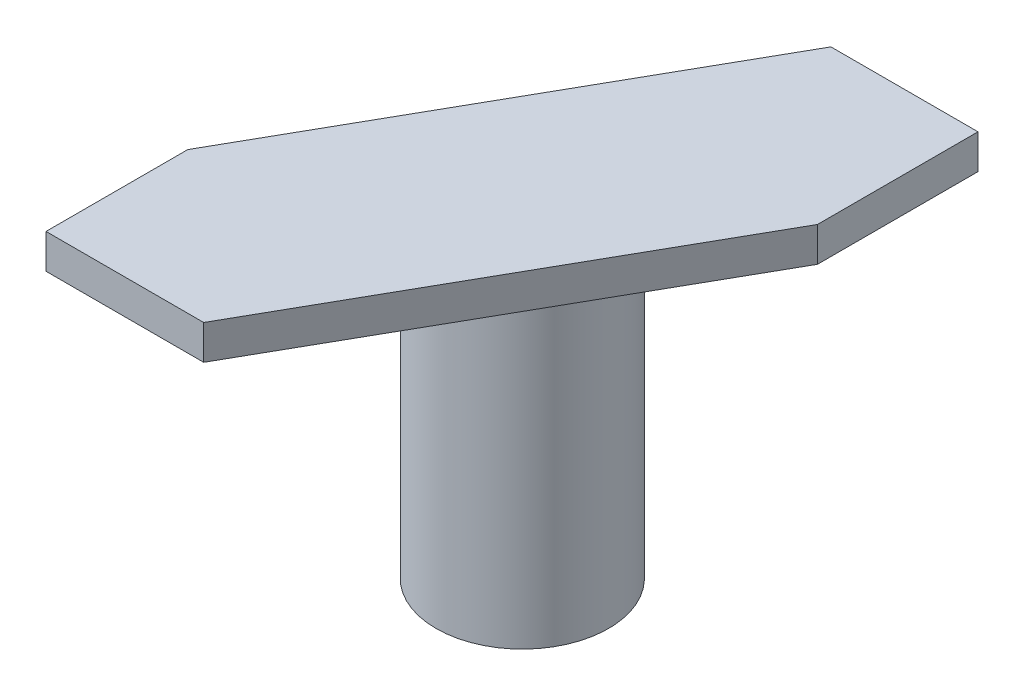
ISO-10303-21;
HEADER;
FILE_DESCRIPTION(('STEP AP214'),'2;1');
FILE_NAME('part.step','',(''),(''),'','','');
FILE_SCHEMA(('AUTOMOTIVE_DESIGN { 1 0 10303 214 1 1 1 1 }'));
ENDSEC;
DATA;
#1=APPLICATION_CONTEXT('core data for automotive mechanical design processes');
#2=APPLICATION_PROTOCOL_DEFINITION('international standard','automotive_design',2000,#1);
#3=PRODUCT_CONTEXT('',#1,'mechanical');
#4=PRODUCT('Part','Part','',(#3));
#5=PRODUCT_RELATED_PRODUCT_CATEGORY('part','',(#4));
#6=PRODUCT_DEFINITION_FORMATION('','',#4);
#7=PRODUCT_DEFINITION_CONTEXT('part definition',#1,'design');
#8=PRODUCT_DEFINITION('design','',#6,#7);
#9=PRODUCT_DEFINITION_SHAPE('','',#8);
#10=(LENGTH_UNIT() NAMED_UNIT(*) SI_UNIT(.MILLI.,.METRE.));
#11=(NAMED_UNIT(*) PLANE_ANGLE_UNIT() SI_UNIT($,.RADIAN.));
#12=(NAMED_UNIT(*) SI_UNIT($,.STERADIAN.) SOLID_ANGLE_UNIT());
#13=UNCERTAINTY_MEASURE_WITH_UNIT(LENGTH_MEASURE(1.E-05),#10,'distance_accuracy_value','');
#14=(GEOMETRIC_REPRESENTATION_CONTEXT(3) GLOBAL_UNCERTAINTY_ASSIGNED_CONTEXT((#13)) GLOBAL_UNIT_ASSIGNED_CONTEXT((#10,
#11,#12)) REPRESENTATION_CONTEXT('',''));
#15=CARTESIAN_POINT('',(0.,0.,0.));
#16=DIRECTION('',(0.,0.,1.));
#17=DIRECTION('',(1.,0.,0.));
#18=AXIS2_PLACEMENT_3D('',#15,#16,#17);
#19=CARTESIAN_POINT('',(-5.61205530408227,1.,7.24112996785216));
#20=DIRECTION('',(0.870010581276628,0.,0.493033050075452));
#21=DIRECTION('',(0.493033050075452,0.,-0.870010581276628));
#22=AXIS2_PLACEMENT_3D('',#19,#20,#21);
#23=PLANE('',#22);
#24=DIRECTION('',(-0.493033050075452,0.,0.870010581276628));
#25=VECTOR('',#24,1.);
#26=CARTESIAN_POINT('',(-5.61205530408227,0.,7.24112996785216));
#27=LINE('',#26,#25);
#28=CARTESIAN_POINT('',(1.1272308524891,0.,-4.6510753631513));
#29=VERTEX_POINT('',#28);
#30=CARTESIAN_POINT('',(-5.61205530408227,0.,7.24112996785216));
#31=VERTEX_POINT('',#30);
#32=EDGE_CURVE('E117',#29,#31,#27,.T.);
#33=ORIENTED_EDGE('',*,*,#32,.T.);
#34=DIRECTION('',(0.,-1.,0.));
#35=VECTOR('',#34,1.);
#36=CARTESIAN_POINT('',(-5.61205530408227,1.,7.24112996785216));
#37=LINE('',#36,#35);
#38=CARTESIAN_POINT('',(-5.61205530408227,1.,7.24112996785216));
#39=VERTEX_POINT('',#38);
#40=EDGE_CURVE('E11',#39,#31,#37,.T.);
#41=ORIENTED_EDGE('',*,*,#40,.F.);
#42=DIRECTION('',(-0.493033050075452,0.,0.870010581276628));
#43=VECTOR('',#42,1.);
#44=CARTESIAN_POINT('',(-5.61205530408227,1.,7.24112996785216));
#45=LINE('',#44,#43);
#46=CARTESIAN_POINT('',(1.1272308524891,1.,-4.6510753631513));
#47=VERTEX_POINT('',#46);
#48=EDGE_CURVE('E128',#47,#39,#45,.T.);
#49=ORIENTED_EDGE('',*,*,#48,.F.);
#50=DIRECTION('',(0.,-1.,0.));
#51=VECTOR('',#50,1.);
#52=CARTESIAN_POINT('',(1.1272308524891,1.,-4.6510753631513));
#53=LINE('',#52,#51);
#54=EDGE_CURVE('E113',#47,#29,#53,.T.);
#55=ORIENTED_EDGE('',*,*,#54,.T.);
#56=EDGE_LOOP('',(#33,#41,#49,#55));
#57=FACE_BOUND('',#56,.T.);
#58=ADVANCED_FACE('F33',(#57),#23,.F.);
#59=CARTESIAN_POINT('',(-5.61205530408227,1.,11.3489246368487));
#60=DIRECTION('',(1.,0.,0.));
#61=DIRECTION('',(0.,0.,-1.));
#62=AXIS2_PLACEMENT_3D('',#59,#60,#61);
#63=PLANE('',#62);
#64=DIRECTION('',(0.,0.,1.));
#65=VECTOR('',#64,1.);
#66=CARTESIAN_POINT('',(-5.61205530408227,0.,11.3489246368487));
#67=LINE('',#66,#65);
#68=CARTESIAN_POINT('',(-5.61205530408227,0.,11.3489246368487));
#69=VERTEX_POINT('',#68);
#70=EDGE_CURVE('E120',#31,#69,#67,.T.);
#71=ORIENTED_EDGE('',*,*,#70,.T.);
#72=DIRECTION('',(0.,-1.,0.));
#73=VECTOR('',#72,1.);
#74=CARTESIAN_POINT('',(-5.61205530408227,1.,11.3489246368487));
#75=LINE('',#74,#73);
#76=CARTESIAN_POINT('',(-5.61205530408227,1.,11.3489246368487));
#77=VERTEX_POINT('',#76);
#78=EDGE_CURVE('E41',#77,#69,#75,.T.);
#79=ORIENTED_EDGE('',*,*,#78,.F.);
#80=DIRECTION('',(0.,0.,1.));
#81=VECTOR('',#80,1.);
#82=CARTESIAN_POINT('',(-5.61205530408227,1.,11.3489246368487));
#83=LINE('',#82,#81);
#84=EDGE_CURVE('E86',#39,#77,#83,.T.);
#85=ORIENTED_EDGE('',*,*,#84,.F.);
#86=ORIENTED_EDGE('',*,*,#40,.T.);
#87=EDGE_LOOP('',(#71,#79,#85,#86));
#88=FACE_BOUND('',#87,.T.);
#89=ADVANCED_FACE('F152',(#88),#63,.F.);
#90=CARTESIAN_POINT('',(-1.04346550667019,1.,11.3489246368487));
#91=DIRECTION('',(0.,0.,-1.));
#92=DIRECTION('',(-1.,0.,0.));
#93=AXIS2_PLACEMENT_3D('',#90,#91,#92);
#94=PLANE('',#93);
#95=DIRECTION('',(1.,0.,0.));
#96=VECTOR('',#95,1.);
#97=CARTESIAN_POINT('',(-1.04346550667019,0.,11.3489246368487));
#98=LINE('',#97,#96);
#99=CARTESIAN_POINT('',(-1.04346550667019,0.,11.3489246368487));
#100=VERTEX_POINT('',#99);
#101=EDGE_CURVE('E123',#69,#100,#98,.T.);
#102=ORIENTED_EDGE('',*,*,#101,.T.);
#103=DIRECTION('',(0.,-1.,0.));
#104=VECTOR('',#103,1.);
#105=CARTESIAN_POINT('',(-1.04346550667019,1.,11.3489246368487));
#106=LINE('',#105,#104);
#107=CARTESIAN_POINT('',(-1.04346550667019,1.,11.3489246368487));
#108=VERTEX_POINT('',#107);
#109=EDGE_CURVE('E108',#108,#100,#106,.T.);
#110=ORIENTED_EDGE('',*,*,#109,.F.);
#111=DIRECTION('',(1.,0.,0.));
#112=VECTOR('',#111,1.);
#113=CARTESIAN_POINT('',(-1.04346550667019,1.,11.3489246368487));
#114=LINE('',#113,#112);
#115=EDGE_CURVE('E99',#77,#108,#114,.T.);
#116=ORIENTED_EDGE('',*,*,#115,.F.);
#117=ORIENTED_EDGE('',*,*,#78,.T.);
#118=EDGE_LOOP('',(#102,#110,#116,#117));
#119=FACE_BOUND('',#118,.T.);
#120=ADVANCED_FACE('F134',(#119),#94,.F.);
#121=CARTESIAN_POINT('',(5.38794469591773,1.,0.));
#122=DIRECTION('',(-0.870010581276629,0.,-0.493033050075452));
#123=DIRECTION('',(-0.493033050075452,0.,0.870010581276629));
#124=AXIS2_PLACEMENT_3D('',#121,#122,#123);
#125=PLANE('',#124);
#126=DIRECTION('',(0.493033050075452,0.,-0.870010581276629));
#127=VECTOR('',#126,1.);
#128=CARTESIAN_POINT('',(5.38794469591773,0.,0.));
#129=LINE('',#128,#127);
#130=CARTESIAN_POINT('',(5.38794469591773,0.,0.));
#131=VERTEX_POINT('',#130);
#132=EDGE_CURVE('E107',#100,#131,#129,.T.);
#133=ORIENTED_EDGE('',*,*,#132,.T.);
#134=DIRECTION('',(0.,-1.,0.));
#135=VECTOR('',#134,1.);
#136=CARTESIAN_POINT('',(5.38794469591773,1.,0.));
#137=LINE('',#136,#135);
#138=CARTESIAN_POINT('',(5.38794469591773,1.,0.));
#139=VERTEX_POINT('',#138);
#140=EDGE_CURVE('E104',#139,#131,#137,.T.);
#141=ORIENTED_EDGE('',*,*,#140,.F.);
#142=DIRECTION('',(0.493033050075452,0.,-0.870010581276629));
#143=VECTOR('',#142,1.);
#144=CARTESIAN_POINT('',(5.38794469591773,1.,0.));
#145=LINE('',#144,#143);
#146=EDGE_CURVE('E93',#108,#139,#145,.T.);
#147=ORIENTED_EDGE('',*,*,#146,.F.);
#148=ORIENTED_EDGE('',*,*,#109,.T.);
#149=EDGE_LOOP('',(#133,#141,#147,#148));
#150=FACE_BOUND('',#149,.T.);
#151=ADVANCED_FACE('F105',(#150),#125,.F.);
#152=CARTESIAN_POINT('',(5.38794469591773,1.,-4.6510753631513));
#153=DIRECTION('',(-1.,0.,0.));
#154=DIRECTION('',(0.,0.,1.));
#155=AXIS2_PLACEMENT_3D('',#152,#153,#154);
#156=PLANE('',#155);
#157=DIRECTION('',(0.,0.,-1.));
#158=VECTOR('',#157,1.);
#159=CARTESIAN_POINT('',(5.38794469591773,0.,-4.6510753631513));
#160=LINE('',#159,#158);
#161=CARTESIAN_POINT('',(5.38794469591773,0.,-4.6510753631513));
#162=VERTEX_POINT('',#161);
#163=EDGE_CURVE('E72',#131,#162,#160,.T.);
#164=ORIENTED_EDGE('',*,*,#163,.T.);
#165=DIRECTION('',(0.,-1.,0.));
#166=VECTOR('',#165,1.);
#167=CARTESIAN_POINT('',(5.38794469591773,1.,-4.6510753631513));
#168=LINE('',#167,#166);
#169=CARTESIAN_POINT('',(5.38794469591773,1.,-4.6510753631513));
#170=VERTEX_POINT('',#169);
#171=EDGE_CURVE('E109',#170,#162,#168,.T.);
#172=ORIENTED_EDGE('',*,*,#171,.F.);
#173=DIRECTION('',(0.,0.,-1.));
#174=VECTOR('',#173,1.);
#175=CARTESIAN_POINT('',(5.38794469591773,1.,-4.6510753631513));
#176=LINE('',#175,#174);
#177=EDGE_CURVE('E97',#139,#170,#176,.T.);
#178=ORIENTED_EDGE('',*,*,#177,.F.);
#179=ORIENTED_EDGE('',*,*,#140,.T.);
#180=EDGE_LOOP('',(#164,#172,#178,#179));
#181=FACE_BOUND('',#180,.T.);
#182=ADVANCED_FACE('F111',(#181),#156,.F.);
#183=CARTESIAN_POINT('',(1.1272308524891,1.,-4.6510753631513));
#184=DIRECTION('',(0.,0.,1.));
#185=DIRECTION('',(1.,0.,0.));
#186=AXIS2_PLACEMENT_3D('',#183,#184,#185);
#187=PLANE('',#186);
#188=DIRECTION('',(-1.,0.,0.));
#189=VECTOR('',#188,1.);
#190=CARTESIAN_POINT('',(1.1272308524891,0.,-4.6510753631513));
#191=LINE('',#190,#189);
#192=EDGE_CURVE('E78',#162,#29,#191,.T.);
#193=ORIENTED_EDGE('',*,*,#192,.T.);
#194=ORIENTED_EDGE('',*,*,#54,.F.);
#195=DIRECTION('',(-1.,0.,0.));
#196=VECTOR('',#195,1.);
#197=CARTESIAN_POINT('',(1.1272308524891,1.,-4.6510753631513));
#198=LINE('',#197,#196);
#199=EDGE_CURVE('E49',#170,#47,#198,.T.);
#200=ORIENTED_EDGE('',*,*,#199,.F.);
#201=ORIENTED_EDGE('',*,*,#171,.T.);
#202=EDGE_LOOP('',(#193,#194,#200,#201));
#203=FACE_BOUND('',#202,.T.);
#204=ADVANCED_FACE('F141',(#203),#187,.F.);
#205=CARTESIAN_POINT('',(0.,1.,0.));
#206=DIRECTION('',(0.,-1.,0.));
#207=DIRECTION('',(0.,0.,-1.));
#208=AXIS2_PLACEMENT_3D('',#205,#206,#207);
#209=PLANE('',#208);
#210=ORIENTED_EDGE('',*,*,#48,.T.);
#211=ORIENTED_EDGE('',*,*,#84,.T.);
#212=ORIENTED_EDGE('',*,*,#115,.T.);
#213=ORIENTED_EDGE('',*,*,#146,.T.);
#214=ORIENTED_EDGE('',*,*,#177,.T.);
#215=ORIENTED_EDGE('',*,*,#199,.T.);
#216=EDGE_LOOP('',(#210,#211,#212,#213,#214,#215));
#217=FACE_BOUND('',#216,.T.);
#218=ADVANCED_FACE('F95',(#217),#209,.F.);
#219=CARTESIAN_POINT('',(0.,0.,0.));
#220=DIRECTION('',(0.,-1.,0.));
#221=DIRECTION('',(0.,0.,-1.));
#222=AXIS2_PLACEMENT_3D('',#219,#220,#221);
#223=PLANE('',#222);
#224=CARTESIAN_POINT('',(0.,0.,3.16189984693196));
#225=DIRECTION('',(0.,1.,0.));
#226=DIRECTION('',(0.,0.,1.));
#227=AXIS2_PLACEMENT_3D('',#224,#225,#226);
#228=CIRCLE('',#227,2.5);
#229=CARTESIAN_POINT('',(0.,0.,5.66189984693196));
#230=VERTEX_POINT('',#229);
#231=EDGE_CURVE('E214',#230,#230,#228,.T.);
#232=ORIENTED_EDGE('',*,*,#231,.T.);
#233=EDGE_LOOP('',(#232));
#234=FACE_BOUND('',#233,.T.);
#235=ORIENTED_EDGE('',*,*,#32,.F.);
#236=ORIENTED_EDGE('',*,*,#192,.F.);
#237=ORIENTED_EDGE('',*,*,#163,.F.);
#238=ORIENTED_EDGE('',*,*,#132,.F.);
#239=ORIENTED_EDGE('',*,*,#101,.F.);
#240=ORIENTED_EDGE('',*,*,#70,.F.);
#241=EDGE_LOOP('',(#235,#236,#237,#238,#239,#240));
#242=FACE_BOUND('',#241,.T.);
#243=ADVANCED_FACE('F137',(#234,#242),#223,.T.);
#244=CARTESIAN_POINT('',(0.,-9.,3.16189984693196));
#245=DIRECTION('',(0.,1.,0.));
#246=DIRECTION('',(0.,0.,1.));
#247=AXIS2_PLACEMENT_3D('',#244,#245,#246);
#248=CYLINDRICAL_SURFACE('',#247,2.5);
#249=CARTESIAN_POINT('',(0.,-9.,3.16189984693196));
#250=DIRECTION('',(0.,1.,0.));
#251=DIRECTION('',(0.,0.,1.));
#252=AXIS2_PLACEMENT_3D('',#249,#250,#251);
#253=CIRCLE('',#252,2.5);
#254=CARTESIAN_POINT('',(0.,-9.,5.66189984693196));
#255=VERTEX_POINT('',#254);
#256=EDGE_CURVE('E121',#255,#255,#253,.T.);
#257=ORIENTED_EDGE('',*,*,#256,.T.);
#258=EDGE_LOOP('',(#257));
#259=FACE_BOUND('',#258,.T.);
#260=ORIENTED_EDGE('',*,*,#231,.F.);
#261=EDGE_LOOP('',(#260));
#262=FACE_BOUND('',#261,.T.);
#263=ADVANCED_FACE('F189',(#259,#262),#248,.T.);
#264=CARTESIAN_POINT('',(0.,-9.,3.16189984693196));
#265=DIRECTION('',(0.,1.,0.));
#266=DIRECTION('',(0.,0.,1.));
#267=AXIS2_PLACEMENT_3D('',#264,#265,#266);
#268=PLANE('',#267);
#269=ORIENTED_EDGE('',*,*,#256,.F.);
#270=EDGE_LOOP('',(#269));
#271=FACE_BOUND('',#270,.T.);
#272=ADVANCED_FACE('F198',(#271),#268,.F.);
#273=CLOSED_SHELL('',(#58,#89,#120,#151,#182,#204,#218,#243,#263,#272));
#274=MANIFOLD_SOLID_BREP('B2',#273);
#275=ADVANCED_BREP_SHAPE_REPRESENTATION('',(#18,#274),#14);
#276=SHAPE_DEFINITION_REPRESENTATION(#9,#275);
ENDSEC;
END-ISO-10303-21;
